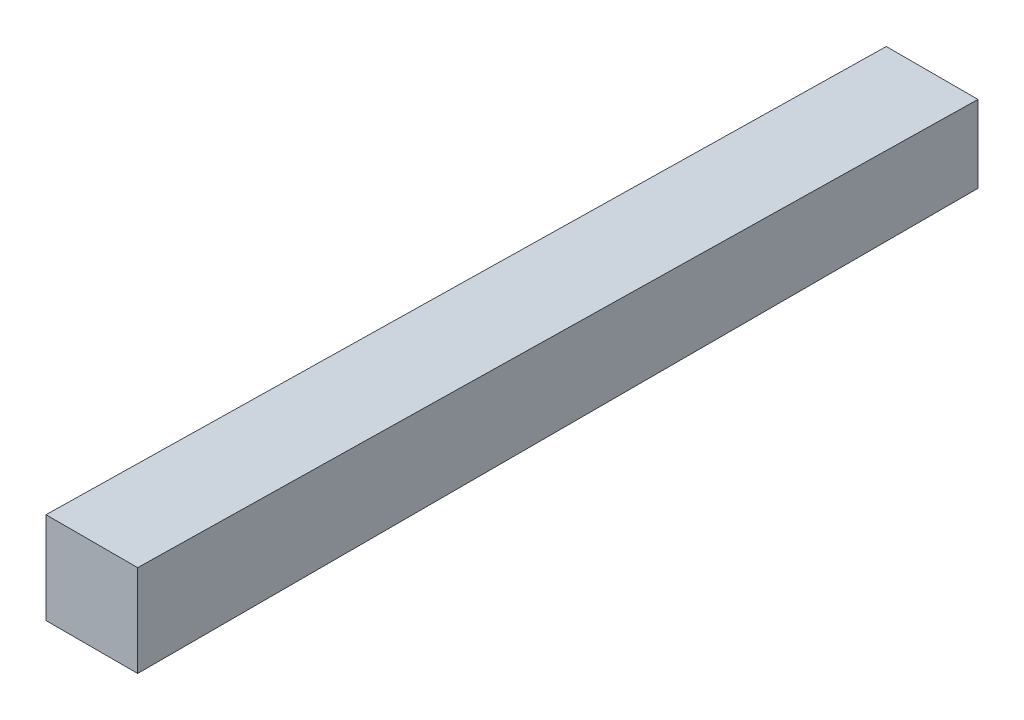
ISO-10303-21;
HEADER;
FILE_DESCRIPTION(('STEP AP214'),'2;1');
FILE_NAME('part.step','',(''),(''),'','','');
FILE_SCHEMA(('AUTOMOTIVE_DESIGN { 1 0 10303 214 1 1 1 1 }'));
ENDSEC;
DATA;
#1=APPLICATION_CONTEXT('core data for automotive mechanical design processes');
#2=APPLICATION_PROTOCOL_DEFINITION('international standard','automotive_design',2000,#1);
#3=PRODUCT_CONTEXT('',#1,'mechanical');
#4=PRODUCT('Part','Part','',(#3));
#5=PRODUCT_RELATED_PRODUCT_CATEGORY('part','',(#4));
#6=PRODUCT_DEFINITION_FORMATION('','',#4);
#7=PRODUCT_DEFINITION_CONTEXT('part definition',#1,'design');
#8=PRODUCT_DEFINITION('design','',#6,#7);
#9=PRODUCT_DEFINITION_SHAPE('','',#8);
#10=(LENGTH_UNIT() NAMED_UNIT(*) SI_UNIT(.MILLI.,.METRE.));
#11=(NAMED_UNIT(*) PLANE_ANGLE_UNIT() SI_UNIT($,.RADIAN.));
#12=(NAMED_UNIT(*) SI_UNIT($,.STERADIAN.) SOLID_ANGLE_UNIT());
#13=UNCERTAINTY_MEASURE_WITH_UNIT(LENGTH_MEASURE(1.E-05),#10,'distance_accuracy_value','');
#14=(GEOMETRIC_REPRESENTATION_CONTEXT(3) GLOBAL_UNCERTAINTY_ASSIGNED_CONTEXT((#13)) GLOBAL_UNIT_ASSIGNED_CONTEXT((#10,
#11,#12)) REPRESENTATION_CONTEXT('',''));
#15=CARTESIAN_POINT('',(0.,0.,0.));
#16=DIRECTION('',(0.,0.,1.));
#17=DIRECTION('',(1.,0.,0.));
#18=AXIS2_PLACEMENT_3D('',#15,#16,#17);
#19=CARTESIAN_POINT('',(3.,-3.,55.));
#20=DIRECTION('',(-1.,0.,0.));
#21=DIRECTION('',(0.,0.,1.));
#22=AXIS2_PLACEMENT_3D('',#19,#20,#21);
#23=PLANE('',#22);
#24=DIRECTION('',(0.,1.,0.));
#25=VECTOR('',#24,1.);
#26=CARTESIAN_POINT('',(3.,-3.,0.));
#27=LINE('',#26,#25);
#28=CARTESIAN_POINT('',(3.,-3.,0.));
#29=VERTEX_POINT('',#28);
#30=CARTESIAN_POINT('',(3.,2.03997142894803,0.));
#31=VERTEX_POINT('',#30);
#32=EDGE_CURVE('E77',#29,#31,#27,.T.);
#33=ORIENTED_EDGE('',*,*,#32,.T.);
#34=DIRECTION('',(0.,0.0174524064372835,0.999847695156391));
#35=VECTOR('',#34,1.);
#36=CARTESIAN_POINT('',(3.,3.,55.));
#37=LINE('',#36,#35);
#38=CARTESIAN_POINT('',(3.,3.,55.));
#39=VERTEX_POINT('',#38);
#40=EDGE_CURVE('E11',#39,#31,#37,.F.);
#41=ORIENTED_EDGE('',*,*,#40,.F.);
#42=DIRECTION('',(0.,1.,0.));
#43=VECTOR('',#42,1.);
#44=CARTESIAN_POINT('',(3.,-3.,55.));
#45=LINE('',#44,#43);
#46=CARTESIAN_POINT('',(3.,-3.,55.));
#47=VERTEX_POINT('',#46);
#48=EDGE_CURVE('E89',#47,#39,#45,.T.);
#49=ORIENTED_EDGE('',*,*,#48,.F.);
#50=DIRECTION('',(0.,0.,-1.));
#51=VECTOR('',#50,1.);
#52=CARTESIAN_POINT('',(3.,-3.,55.));
#53=LINE('',#52,#51);
#54=EDGE_CURVE('E94',#47,#29,#53,.T.);
#55=ORIENTED_EDGE('',*,*,#54,.T.);
#56=EDGE_LOOP('',(#33,#41,#49,#55));
#57=FACE_BOUND('',#56,.T.);
#58=ADVANCED_FACE('F33',(#57),#23,.F.);
#59=CARTESIAN_POINT('',(-3.,3.,55.));
#60=DIRECTION('',(0.,0.999847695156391,-0.0174524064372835));
#61=DIRECTION('',(0.,0.0174524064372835,0.999847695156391));
#62=AXIS2_PLACEMENT_3D('',#59,#60,#61);
#63=PLANE('',#62);
#64=DIRECTION('',(1.,0.,0.));
#65=VECTOR('',#64,1.);
#66=CARTESIAN_POINT('',(0.,2.03997142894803,0.));
#67=LINE('',#66,#65);
#68=CARTESIAN_POINT('',(-3.,2.03997142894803,0.));
#69=VERTEX_POINT('',#68);
#70=EDGE_CURVE('E68',#31,#69,#67,.F.);
#71=ORIENTED_EDGE('',*,*,#70,.T.);
#72=DIRECTION('',(0.,0.0174524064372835,0.999847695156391));
#73=VECTOR('',#72,1.);
#74=CARTESIAN_POINT('',(-3.,2.99817248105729,54.8953015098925));
#75=LINE('',#74,#73);
#76=CARTESIAN_POINT('',(-3.,3.,55.));
#77=VERTEX_POINT('',#76);
#78=EDGE_CURVE('E37',#77,#69,#75,.F.);
#79=ORIENTED_EDGE('',*,*,#78,.F.);
#80=DIRECTION('',(-1.,0.,0.));
#81=VECTOR('',#80,1.);
#82=CARTESIAN_POINT('',(-3.,3.,55.));
#83=LINE('',#82,#81);
#84=EDGE_CURVE('E100',#39,#77,#83,.T.);
#85=ORIENTED_EDGE('',*,*,#84,.F.);
#86=ORIENTED_EDGE('',*,*,#40,.T.);
#87=EDGE_LOOP('',(#71,#79,#85,#86));
#88=FACE_BOUND('',#87,.T.);
#89=ADVANCED_FACE('F35',(#88),#63,.T.);
#90=CARTESIAN_POINT('',(-3.,-3.,55.));
#91=DIRECTION('',(1.,0.,0.));
#92=DIRECTION('',(0.,0.,-1.));
#93=AXIS2_PLACEMENT_3D('',#90,#91,#92);
#94=PLANE('',#93);
#95=DIRECTION('',(0.,-1.,0.));
#96=VECTOR('',#95,1.);
#97=CARTESIAN_POINT('',(-3.,-3.,0.));
#98=LINE('',#97,#96);
#99=CARTESIAN_POINT('',(-3.,-3.,0.));
#100=VERTEX_POINT('',#99);
#101=EDGE_CURVE('E76',#69,#100,#98,.T.);
#102=ORIENTED_EDGE('',*,*,#101,.T.);
#103=DIRECTION('',(0.,0.,-1.));
#104=VECTOR('',#103,1.);
#105=CARTESIAN_POINT('',(-3.,-3.,55.));
#106=LINE('',#105,#104);
#107=CARTESIAN_POINT('',(-3.,-3.,55.));
#108=VERTEX_POINT('',#107);
#109=EDGE_CURVE('E84',#108,#100,#106,.T.);
#110=ORIENTED_EDGE('',*,*,#109,.F.);
#111=DIRECTION('',(0.,-1.,0.));
#112=VECTOR('',#111,1.);
#113=CARTESIAN_POINT('',(-3.,-3.,55.));
#114=LINE('',#113,#112);
#115=EDGE_CURVE('E83',#77,#108,#114,.T.);
#116=ORIENTED_EDGE('',*,*,#115,.F.);
#117=ORIENTED_EDGE('',*,*,#78,.T.);
#118=EDGE_LOOP('',(#102,#110,#116,#117));
#119=FACE_BOUND('',#118,.T.);
#120=ADVANCED_FACE('F80',(#119),#94,.F.);
#121=CARTESIAN_POINT('',(-3.,-3.,55.));
#122=DIRECTION('',(0.,1.,0.));
#123=DIRECTION('',(0.,0.,1.));
#124=AXIS2_PLACEMENT_3D('',#121,#122,#123);
#125=PLANE('',#124);
#126=DIRECTION('',(1.,0.,0.));
#127=VECTOR('',#126,1.);
#128=CARTESIAN_POINT('',(-3.,-3.,0.));
#129=LINE('',#128,#127);
#130=EDGE_CURVE('E87',#100,#29,#129,.T.);
#131=ORIENTED_EDGE('',*,*,#130,.T.);
#132=ORIENTED_EDGE('',*,*,#54,.F.);
#133=DIRECTION('',(1.,0.,0.));
#134=VECTOR('',#133,1.);
#135=CARTESIAN_POINT('',(-3.,-3.,55.));
#136=LINE('',#135,#134);
#137=EDGE_CURVE('E50',#108,#47,#136,.T.);
#138=ORIENTED_EDGE('',*,*,#137,.F.);
#139=ORIENTED_EDGE('',*,*,#109,.T.);
#140=EDGE_LOOP('',(#131,#132,#138,#139));
#141=FACE_BOUND('',#140,.T.);
#142=ADVANCED_FACE('F98',(#141),#125,.F.);
#143=CARTESIAN_POINT('',(0.,0.,55.));
#144=DIRECTION('',(0.,0.,-1.));
#145=DIRECTION('',(-1.,0.,0.));
#146=AXIS2_PLACEMENT_3D('',#143,#144,#145);
#147=PLANE('',#146);
#148=ORIENTED_EDGE('',*,*,#48,.T.);
#149=ORIENTED_EDGE('',*,*,#84,.T.);
#150=ORIENTED_EDGE('',*,*,#115,.T.);
#151=ORIENTED_EDGE('',*,*,#137,.T.);
#152=EDGE_LOOP('',(#148,#149,#150,#151));
#153=FACE_BOUND('',#152,.T.);
#154=ADVANCED_FACE('F105',(#153),#147,.F.);
#155=CARTESIAN_POINT('',(0.,0.,0.));
#156=DIRECTION('',(0.,0.,-1.));
#157=DIRECTION('',(-1.,0.,0.));
#158=AXIS2_PLACEMENT_3D('',#155,#156,#157);
#159=PLANE('',#158);
#160=ORIENTED_EDGE('',*,*,#32,.F.);
#161=ORIENTED_EDGE('',*,*,#130,.F.);
#162=ORIENTED_EDGE('',*,*,#101,.F.);
#163=ORIENTED_EDGE('',*,*,#70,.F.);
#164=EDGE_LOOP('',(#160,#161,#162,#163));
#165=FACE_BOUND('',#164,.T.);
#166=ADVANCED_FACE('F86',(#165),#159,.T.);
#167=CLOSED_SHELL('',(#58,#89,#120,#142,#154,#166));
#168=MANIFOLD_SOLID_BREP('B2',#167);
#169=ADVANCED_BREP_SHAPE_REPRESENTATION('',(#18,#168),#14);
#170=SHAPE_DEFINITION_REPRESENTATION(#9,#169);
ENDSEC;
END-ISO-10303-21;
